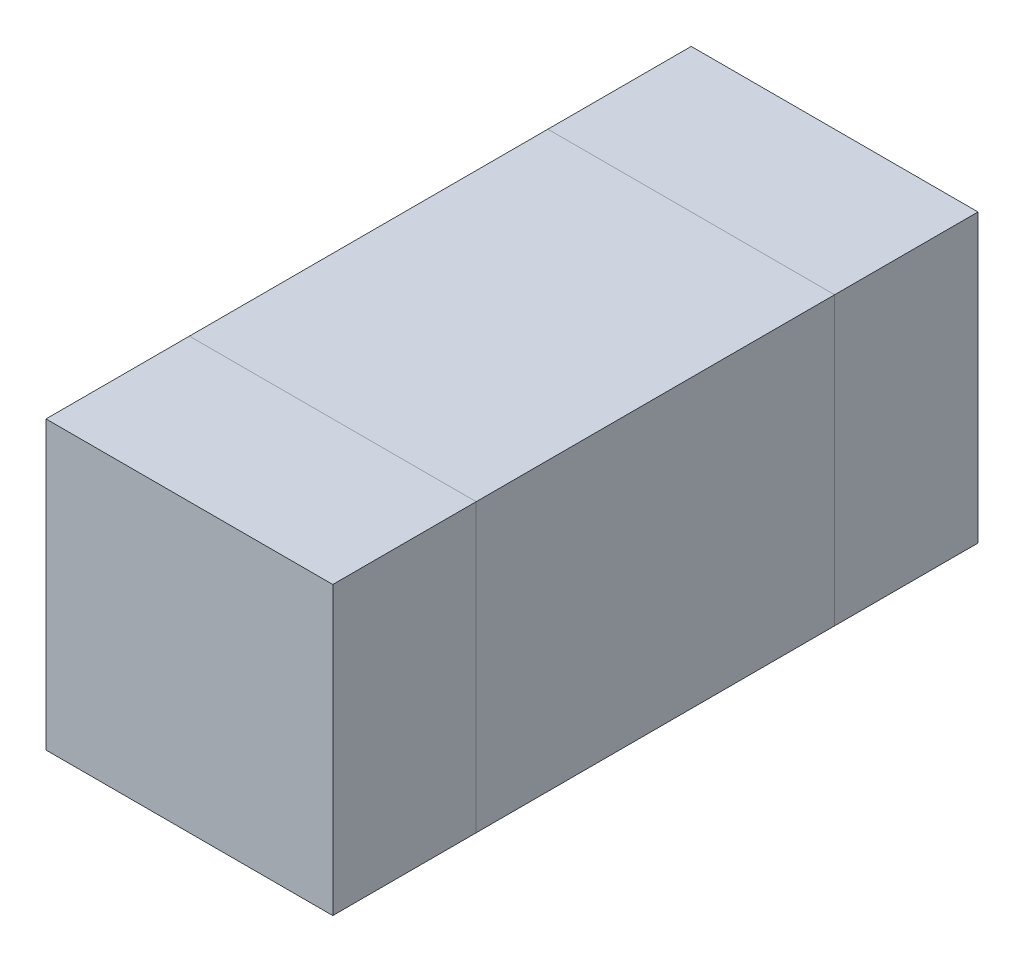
ISO-10303-21;
HEADER;
FILE_DESCRIPTION(('STEP AP214'),'2;1');
FILE_NAME('part.step','',(''),(''),'','','');
FILE_SCHEMA(('AUTOMOTIVE_DESIGN { 1 0 10303 214 1 1 1 1 }'));
ENDSEC;
DATA;
#1=APPLICATION_CONTEXT('core data for automotive mechanical design processes');
#2=APPLICATION_PROTOCOL_DEFINITION('international standard','automotive_design',2000,#1);
#3=PRODUCT_CONTEXT('',#1,'mechanical');
#4=PRODUCT('Part','Part','',(#3));
#5=PRODUCT_RELATED_PRODUCT_CATEGORY('part','',(#4));
#6=PRODUCT_DEFINITION_FORMATION('','',#4);
#7=PRODUCT_DEFINITION_CONTEXT('part definition',#1,'design');
#8=PRODUCT_DEFINITION('design','',#6,#7);
#9=PRODUCT_DEFINITION_SHAPE('','',#8);
#10=(LENGTH_UNIT() NAMED_UNIT(*) SI_UNIT(.MILLI.,.METRE.));
#11=(NAMED_UNIT(*) PLANE_ANGLE_UNIT() SI_UNIT($,.RADIAN.));
#12=(NAMED_UNIT(*) SI_UNIT($,.STERADIAN.) SOLID_ANGLE_UNIT());
#13=UNCERTAINTY_MEASURE_WITH_UNIT(LENGTH_MEASURE(1.E-05),#10,'distance_accuracy_value','');
#14=(GEOMETRIC_REPRESENTATION_CONTEXT(3) GLOBAL_UNCERTAINTY_ASSIGNED_CONTEXT((#13)) GLOBAL_UNIT_ASSIGNED_CONTEXT((#10,
#11,#12)) REPRESENTATION_CONTEXT('',''));
#15=CARTESIAN_POINT('',(0.,0.,0.));
#16=DIRECTION('',(0.,0.,1.));
#17=DIRECTION('',(1.,0.,0.));
#18=AXIS2_PLACEMENT_3D('',#15,#16,#17);
#19=CARTESIAN_POINT('',(0.,0.8,0.));
#20=DIRECTION('',(0.,1.,0.));
#21=DIRECTION('',(0.,0.,1.));
#22=AXIS2_PLACEMENT_3D('',#19,#20,#21);
#23=PLANE('',#22);
#24=DIRECTION('',(0.,0.,-1.));
#25=VECTOR('',#24,1.);
#26=CARTESIAN_POINT('',(-0.4,0.8,-0.5));
#27=LINE('',#26,#25);
#28=CARTESIAN_POINT('',(-0.4,0.8,-0.5));
#29=VERTEX_POINT('',#28);
#30=CARTESIAN_POINT('',(-0.4,0.8,-0.9));
#31=VERTEX_POINT('',#30);
#32=EDGE_CURVE('E51',#29,#31,#27,.T.);
#33=ORIENTED_EDGE('',*,*,#32,.F.);
#34=DIRECTION('',(-1.,0.,0.));
#35=VECTOR('',#34,1.);
#36=CARTESIAN_POINT('',(-0.4,0.8,-0.5));
#37=LINE('',#36,#35);
#38=CARTESIAN_POINT('',(0.4,0.8,-0.5));
#39=VERTEX_POINT('',#38);
#40=EDGE_CURVE('E74',#39,#29,#37,.T.);
#41=ORIENTED_EDGE('',*,*,#40,.F.);
#42=DIRECTION('',(0.,0.,1.));
#43=VECTOR('',#42,1.);
#44=CARTESIAN_POINT('',(0.4,0.8,-0.5));
#45=LINE('',#44,#43);
#46=CARTESIAN_POINT('',(0.4,0.8,-0.9));
#47=VERTEX_POINT('',#46);
#48=EDGE_CURVE('E79',#47,#39,#45,.T.);
#49=ORIENTED_EDGE('',*,*,#48,.F.);
#50=DIRECTION('',(1.,0.,0.));
#51=VECTOR('',#50,1.);
#52=CARTESIAN_POINT('',(-0.4,0.8,-0.9));
#53=LINE('',#52,#51);
#54=EDGE_CURVE('E94',#31,#47,#53,.T.);
#55=ORIENTED_EDGE('',*,*,#54,.F.);
#56=EDGE_LOOP('',(#33,#41,#49,#55));
#57=FACE_BOUND('',#56,.T.);
#58=ADVANCED_FACE('F43',(#57),#23,.T.);
#59=CARTESIAN_POINT('',(0.,0.,0.));
#60=DIRECTION('',(0.,-1.,0.));
#61=DIRECTION('',(0.,0.,-1.));
#62=AXIS2_PLACEMENT_3D('',#59,#60,#61);
#63=PLANE('',#62);
#64=DIRECTION('',(0.,0.,-1.));
#65=VECTOR('',#64,1.);
#66=CARTESIAN_POINT('',(-0.4,0.,-0.5));
#67=LINE('',#66,#65);
#68=CARTESIAN_POINT('',(-0.4,0.,-0.5));
#69=VERTEX_POINT('',#68);
#70=CARTESIAN_POINT('',(-0.4,0.,-0.9));
#71=VERTEX_POINT('',#70);
#72=EDGE_CURVE('E103',#69,#71,#67,.T.);
#73=ORIENTED_EDGE('',*,*,#72,.T.);
#74=DIRECTION('',(1.,0.,0.));
#75=VECTOR('',#74,1.);
#76=CARTESIAN_POINT('',(-0.4,0.,-0.9));
#77=LINE('',#76,#75);
#78=CARTESIAN_POINT('',(0.4,0.,-0.9));
#79=VERTEX_POINT('',#78);
#80=EDGE_CURVE('E92',#71,#79,#77,.T.);
#81=ORIENTED_EDGE('',*,*,#80,.T.);
#82=DIRECTION('',(0.,0.,1.));
#83=VECTOR('',#82,1.);
#84=CARTESIAN_POINT('',(0.4,0.,-0.5));
#85=LINE('',#84,#83);
#86=CARTESIAN_POINT('',(0.4,0.,-0.5));
#87=VERTEX_POINT('',#86);
#88=EDGE_CURVE('E95',#79,#87,#85,.T.);
#89=ORIENTED_EDGE('',*,*,#88,.T.);
#90=DIRECTION('',(-1.,0.,0.));
#91=VECTOR('',#90,1.);
#92=CARTESIAN_POINT('',(-0.4,0.,-0.5));
#93=LINE('',#92,#91);
#94=EDGE_CURVE('E100',#87,#69,#93,.T.);
#95=ORIENTED_EDGE('',*,*,#94,.T.);
#96=EDGE_LOOP('',(#73,#81,#89,#95));
#97=FACE_BOUND('',#96,.T.);
#98=ADVANCED_FACE('F102',(#97),#63,.T.);
#99=CARTESIAN_POINT('',(-0.4,1.69442719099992,-0.9));
#100=DIRECTION('',(0.,0.,-1.));
#101=DIRECTION('',(-1.,0.,0.));
#102=AXIS2_PLACEMENT_3D('',#99,#100,#101);
#103=PLANE('',#102);
#104=DIRECTION('',(0.,-1.,0.));
#105=VECTOR('',#104,1.);
#106=CARTESIAN_POINT('',(-0.4,1.69442719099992,-0.9));
#107=LINE('',#106,#105);
#108=EDGE_CURVE('E12',#31,#71,#107,.T.);
#109=ORIENTED_EDGE('',*,*,#108,.F.);
#110=ORIENTED_EDGE('',*,*,#54,.T.);
#111=DIRECTION('',(0.,-1.,0.));
#112=VECTOR('',#111,1.);
#113=CARTESIAN_POINT('',(0.4,1.69442719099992,-0.9));
#114=LINE('',#113,#112);
#115=EDGE_CURVE('E89',#47,#79,#114,.T.);
#116=ORIENTED_EDGE('',*,*,#115,.T.);
#117=ORIENTED_EDGE('',*,*,#80,.F.);
#118=EDGE_LOOP('',(#109,#110,#116,#117));
#119=FACE_BOUND('',#118,.T.);
#120=ADVANCED_FACE('F90',(#119),#103,.T.);
#121=CARTESIAN_POINT('',(0.4,1.69442719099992,-0.5));
#122=DIRECTION('',(1.,0.,0.));
#123=DIRECTION('',(0.,0.,-1.));
#124=AXIS2_PLACEMENT_3D('',#121,#122,#123);
#125=PLANE('',#124);
#126=ORIENTED_EDGE('',*,*,#115,.F.);
#127=ORIENTED_EDGE('',*,*,#48,.T.);
#128=DIRECTION('',(0.,-1.,0.));
#129=VECTOR('',#128,1.);
#130=CARTESIAN_POINT('',(0.4,1.69442719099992,-0.5));
#131=LINE('',#130,#129);
#132=EDGE_CURVE('E84',#39,#87,#131,.T.);
#133=ORIENTED_EDGE('',*,*,#132,.T.);
#134=ORIENTED_EDGE('',*,*,#88,.F.);
#135=EDGE_LOOP('',(#126,#127,#133,#134));
#136=FACE_BOUND('',#135,.T.);
#137=ADVANCED_FACE('F96',(#136),#125,.T.);
#138=CARTESIAN_POINT('',(-0.4,1.69442719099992,-0.5));
#139=DIRECTION('',(0.,0.,1.));
#140=DIRECTION('',(1.,0.,0.));
#141=AXIS2_PLACEMENT_3D('',#138,#139,#140);
#142=PLANE('',#141);
#143=ORIENTED_EDGE('',*,*,#132,.F.);
#144=ORIENTED_EDGE('',*,*,#40,.T.);
#145=DIRECTION('',(0.,-1.,0.));
#146=VECTOR('',#145,1.);
#147=CARTESIAN_POINT('',(-0.4,1.69442719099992,-0.5));
#148=LINE('',#147,#146);
#149=EDGE_CURVE('E110',#29,#69,#148,.T.);
#150=ORIENTED_EDGE('',*,*,#149,.T.);
#151=ORIENTED_EDGE('',*,*,#94,.F.);
#152=EDGE_LOOP('',(#143,#144,#150,#151));
#153=FACE_BOUND('',#152,.T.);
#154=ADVANCED_FACE('F116',(#153),#142,.T.);
#155=CARTESIAN_POINT('',(-0.4,1.69442719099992,-0.5));
#156=DIRECTION('',(-1.,0.,0.));
#157=DIRECTION('',(0.,0.,1.));
#158=AXIS2_PLACEMENT_3D('',#155,#156,#157);
#159=PLANE('',#158);
#160=ORIENTED_EDGE('',*,*,#149,.F.);
#161=ORIENTED_EDGE('',*,*,#32,.T.);
#162=ORIENTED_EDGE('',*,*,#108,.T.);
#163=ORIENTED_EDGE('',*,*,#72,.F.);
#164=EDGE_LOOP('',(#160,#161,#162,#163));
#165=FACE_BOUND('',#164,.T.);
#166=ADVANCED_FACE('F117',(#165),#159,.T.);
#167=CLOSED_SHELL('',(#58,#98,#120,#137,#154,#166));
#168=MANIFOLD_SOLID_BREP('B2',#167);
#169=CARTESIAN_POINT('',(0.,0.8,0.));
#170=DIRECTION('',(0.,1.,0.));
#171=DIRECTION('',(0.,0.,1.));
#172=AXIS2_PLACEMENT_3D('',#169,#170,#171);
#173=PLANE('',#172);
#174=DIRECTION('',(0.,0.,-1.));
#175=VECTOR('',#174,1.);
#176=CARTESIAN_POINT('',(-0.4,0.8,0.5));
#177=LINE('',#176,#175);
#178=CARTESIAN_POINT('',(-0.4,0.8,0.9));
#179=VERTEX_POINT('',#178);
#180=CARTESIAN_POINT('',(-0.4,0.8,0.5));
#181=VERTEX_POINT('',#180);
#182=EDGE_CURVE('E183',#179,#181,#177,.T.);
#183=ORIENTED_EDGE('',*,*,#182,.F.);
#184=DIRECTION('',(-1.,0.,0.));
#185=VECTOR('',#184,1.);
#186=CARTESIAN_POINT('',(-0.4,0.8,0.9));
#187=LINE('',#186,#185);
#188=CARTESIAN_POINT('',(0.4,0.8,0.9));
#189=VERTEX_POINT('',#188);
#190=EDGE_CURVE('E206',#189,#179,#187,.T.);
#191=ORIENTED_EDGE('',*,*,#190,.F.);
#192=DIRECTION('',(0.,0.,1.));
#193=VECTOR('',#192,1.);
#194=CARTESIAN_POINT('',(0.4,0.8,0.5));
#195=LINE('',#194,#193);
#196=CARTESIAN_POINT('',(0.4,0.8,0.5));
#197=VERTEX_POINT('',#196);
#198=EDGE_CURVE('E211',#197,#189,#195,.T.);
#199=ORIENTED_EDGE('',*,*,#198,.F.);
#200=DIRECTION('',(1.,0.,0.));
#201=VECTOR('',#200,1.);
#202=CARTESIAN_POINT('',(-0.4,0.8,0.5));
#203=LINE('',#202,#201);
#204=EDGE_CURVE('E226',#181,#197,#203,.T.);
#205=ORIENTED_EDGE('',*,*,#204,.F.);
#206=EDGE_LOOP('',(#183,#191,#199,#205));
#207=FACE_BOUND('',#206,.T.);
#208=ADVANCED_FACE('F175',(#207),#173,.T.);
#209=CARTESIAN_POINT('',(0.,0.,0.));
#210=DIRECTION('',(0.,1.,0.));
#211=DIRECTION('',(0.,0.,1.));
#212=AXIS2_PLACEMENT_3D('',#209,#210,#211);
#213=PLANE('',#212);
#214=DIRECTION('',(0.,0.,-1.));
#215=VECTOR('',#214,1.);
#216=CARTESIAN_POINT('',(-0.4,0.,0.5));
#217=LINE('',#216,#215);
#218=CARTESIAN_POINT('',(-0.4,0.,0.9));
#219=VERTEX_POINT('',#218);
#220=CARTESIAN_POINT('',(-0.4,0.,0.5));
#221=VERTEX_POINT('',#220);
#222=EDGE_CURVE('E235',#219,#221,#217,.T.);
#223=ORIENTED_EDGE('',*,*,#222,.T.);
#224=DIRECTION('',(1.,0.,0.));
#225=VECTOR('',#224,1.);
#226=CARTESIAN_POINT('',(-0.4,0.,0.5));
#227=LINE('',#226,#225);
#228=CARTESIAN_POINT('',(0.4,0.,0.5));
#229=VERTEX_POINT('',#228);
#230=EDGE_CURVE('E224',#221,#229,#227,.T.);
#231=ORIENTED_EDGE('',*,*,#230,.T.);
#232=DIRECTION('',(0.,0.,1.));
#233=VECTOR('',#232,1.);
#234=CARTESIAN_POINT('',(0.4,0.,0.5));
#235=LINE('',#234,#233);
#236=CARTESIAN_POINT('',(0.4,0.,0.9));
#237=VERTEX_POINT('',#236);
#238=EDGE_CURVE('E227',#229,#237,#235,.T.);
#239=ORIENTED_EDGE('',*,*,#238,.T.);
#240=DIRECTION('',(-1.,0.,0.));
#241=VECTOR('',#240,1.);
#242=CARTESIAN_POINT('',(-0.4,0.,0.9));
#243=LINE('',#242,#241);
#244=EDGE_CURVE('E232',#237,#219,#243,.T.);
#245=ORIENTED_EDGE('',*,*,#244,.T.);
#246=EDGE_LOOP('',(#223,#231,#239,#245));
#247=FACE_BOUND('',#246,.T.);
#248=ADVANCED_FACE('F234',(#247),#213,.F.);
#249=CARTESIAN_POINT('',(-0.4,1.69442719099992,0.5));
#250=DIRECTION('',(0.,0.,-1.));
#251=DIRECTION('',(-1.,0.,0.));
#252=AXIS2_PLACEMENT_3D('',#249,#250,#251);
#253=PLANE('',#252);
#254=DIRECTION('',(0.,-1.,0.));
#255=VECTOR('',#254,1.);
#256=CARTESIAN_POINT('',(-0.4,1.69442719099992,0.5));
#257=LINE('',#256,#255);
#258=EDGE_CURVE('E41',#181,#221,#257,.T.);
#259=ORIENTED_EDGE('',*,*,#258,.F.);
#260=ORIENTED_EDGE('',*,*,#204,.T.);
#261=DIRECTION('',(0.,-1.,0.));
#262=VECTOR('',#261,1.);
#263=CARTESIAN_POINT('',(0.4,1.69442719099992,0.5));
#264=LINE('',#263,#262);
#265=EDGE_CURVE('E221',#197,#229,#264,.T.);
#266=ORIENTED_EDGE('',*,*,#265,.T.);
#267=ORIENTED_EDGE('',*,*,#230,.F.);
#268=EDGE_LOOP('',(#259,#260,#266,#267));
#269=FACE_BOUND('',#268,.T.);
#270=ADVANCED_FACE('F222',(#269),#253,.T.);
#271=CARTESIAN_POINT('',(0.4,1.69442719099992,0.5));
#272=DIRECTION('',(1.,0.,0.));
#273=DIRECTION('',(0.,0.,-1.));
#274=AXIS2_PLACEMENT_3D('',#271,#272,#273);
#275=PLANE('',#274);
#276=ORIENTED_EDGE('',*,*,#265,.F.);
#277=ORIENTED_EDGE('',*,*,#198,.T.);
#278=DIRECTION('',(0.,-1.,0.));
#279=VECTOR('',#278,1.);
#280=CARTESIAN_POINT('',(0.4,1.69442719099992,0.9));
#281=LINE('',#280,#279);
#282=EDGE_CURVE('E216',#189,#237,#281,.T.);
#283=ORIENTED_EDGE('',*,*,#282,.T.);
#284=ORIENTED_EDGE('',*,*,#238,.F.);
#285=EDGE_LOOP('',(#276,#277,#283,#284));
#286=FACE_BOUND('',#285,.T.);
#287=ADVANCED_FACE('F228',(#286),#275,.T.);
#288=CARTESIAN_POINT('',(-0.4,1.69442719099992,0.9));
#289=DIRECTION('',(0.,0.,1.));
#290=DIRECTION('',(1.,0.,0.));
#291=AXIS2_PLACEMENT_3D('',#288,#289,#290);
#292=PLANE('',#291);
#293=ORIENTED_EDGE('',*,*,#282,.F.);
#294=ORIENTED_EDGE('',*,*,#190,.T.);
#295=DIRECTION('',(0.,-1.,0.));
#296=VECTOR('',#295,1.);
#297=CARTESIAN_POINT('',(-0.4,1.69442719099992,0.9));
#298=LINE('',#297,#296);
#299=EDGE_CURVE('E242',#179,#219,#298,.T.);
#300=ORIENTED_EDGE('',*,*,#299,.T.);
#301=ORIENTED_EDGE('',*,*,#244,.F.);
#302=EDGE_LOOP('',(#293,#294,#300,#301));
#303=FACE_BOUND('',#302,.T.);
#304=ADVANCED_FACE('F248',(#303),#292,.T.);
#305=CARTESIAN_POINT('',(-0.4,1.69442719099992,0.5));
#306=DIRECTION('',(-1.,0.,0.));
#307=DIRECTION('',(0.,0.,1.));
#308=AXIS2_PLACEMENT_3D('',#305,#306,#307);
#309=PLANE('',#308);
#310=ORIENTED_EDGE('',*,*,#299,.F.);
#311=ORIENTED_EDGE('',*,*,#182,.T.);
#312=ORIENTED_EDGE('',*,*,#258,.T.);
#313=ORIENTED_EDGE('',*,*,#222,.F.);
#314=EDGE_LOOP('',(#310,#311,#312,#313));
#315=FACE_BOUND('',#314,.T.);
#316=ADVANCED_FACE('F249',(#315),#309,.T.);
#317=CLOSED_SHELL('',(#208,#248,#270,#287,#304,#316));
#318=MANIFOLD_SOLID_BREP('B6',#317);
#319=CARTESIAN_POINT('',(0.4,0.8,-0.5));
#320=DIRECTION('',(-1.,0.,0.));
#321=DIRECTION('',(0.,0.,1.));
#322=AXIS2_PLACEMENT_3D('',#319,#320,#321);
#323=PLANE('',#322);
#324=DIRECTION('',(0.,0.,-1.));
#325=VECTOR('',#324,1.);
#326=CARTESIAN_POINT('',(0.4,0.,-0.5));
#327=LINE('',#326,#325);
#328=CARTESIAN_POINT('',(0.4,0.,0.5));
#329=VERTEX_POINT('',#328);
#330=CARTESIAN_POINT('',(0.4,0.,-0.5));
#331=VERTEX_POINT('',#330);
#332=EDGE_CURVE('E361',#329,#331,#327,.T.);
#333=ORIENTED_EDGE('',*,*,#332,.T.);
#334=DIRECTION('',(0.,-1.,0.));
#335=VECTOR('',#334,1.);
#336=CARTESIAN_POINT('',(0.4,0.8,-0.5));
#337=LINE('',#336,#335);
#338=CARTESIAN_POINT('',(0.4,0.8,-0.5));
#339=VERTEX_POINT('',#338);
#340=EDGE_CURVE('E173',#339,#331,#337,.T.);
#341=ORIENTED_EDGE('',*,*,#340,.F.);
#342=DIRECTION('',(0.,0.,-1.));
#343=VECTOR('',#342,1.);
#344=CARTESIAN_POINT('',(0.4,0.8,-0.5));
#345=LINE('',#344,#343);
#346=CARTESIAN_POINT('',(0.4,0.8,0.5));
#347=VERTEX_POINT('',#346);
#348=EDGE_CURVE('E349',#347,#339,#345,.T.);
#349=ORIENTED_EDGE('',*,*,#348,.F.);
#350=DIRECTION('',(0.,-1.,0.));
#351=VECTOR('',#350,1.);
#352=CARTESIAN_POINT('',(0.4,0.8,0.5));
#353=LINE('',#352,#351);
#354=EDGE_CURVE('E357',#347,#329,#353,.T.);
#355=ORIENTED_EDGE('',*,*,#354,.T.);
#356=EDGE_LOOP('',(#333,#341,#349,#355));
#357=FACE_BOUND('',#356,.T.);
#358=ADVANCED_FACE('F298',(#357),#323,.F.);
#359=CARTESIAN_POINT('',(-0.4,0.8,-0.5));
#360=DIRECTION('',(0.,0.,1.));
#361=DIRECTION('',(1.,0.,0.));
#362=AXIS2_PLACEMENT_3D('',#359,#360,#361);
#363=PLANE('',#362);
#364=DIRECTION('',(-1.,0.,0.));
#365=VECTOR('',#364,1.);
#366=CARTESIAN_POINT('',(-0.4,0.,-0.5));
#367=LINE('',#366,#365);
#368=CARTESIAN_POINT('',(-0.4,0.,-0.5));
#369=VERTEX_POINT('',#368);
#370=EDGE_CURVE('E353',#331,#369,#367,.T.);
#371=ORIENTED_EDGE('',*,*,#370,.T.);
#372=DIRECTION('',(0.,-1.,0.));
#373=VECTOR('',#372,1.);
#374=CARTESIAN_POINT('',(-0.4,0.8,-0.5));
#375=LINE('',#374,#373);
#376=CARTESIAN_POINT('',(-0.4,0.8,-0.5));
#377=VERTEX_POINT('',#376);
#378=EDGE_CURVE('E306',#377,#369,#375,.T.);
#379=ORIENTED_EDGE('',*,*,#378,.F.);
#380=DIRECTION('',(-1.,0.,0.));
#381=VECTOR('',#380,1.);
#382=CARTESIAN_POINT('',(-0.4,0.8,-0.5));
#383=LINE('',#382,#381);
#384=EDGE_CURVE('E344',#339,#377,#383,.T.);
#385=ORIENTED_EDGE('',*,*,#384,.F.);
#386=ORIENTED_EDGE('',*,*,#340,.T.);
#387=EDGE_LOOP('',(#371,#379,#385,#386));
#388=FACE_BOUND('',#387,.T.);
#389=ADVANCED_FACE('F352',(#388),#363,.F.);
#390=CARTESIAN_POINT('',(-0.4,0.8,-0.5));
#391=DIRECTION('',(1.,0.,0.));
#392=DIRECTION('',(0.,0.,-1.));
#393=AXIS2_PLACEMENT_3D('',#390,#391,#392);
#394=PLANE('',#393);
#395=DIRECTION('',(0.,0.,1.));
#396=VECTOR('',#395,1.);
#397=CARTESIAN_POINT('',(-0.4,0.,-0.5));
#398=LINE('',#397,#396);
#399=CARTESIAN_POINT('',(-0.4,0.,0.5));
#400=VERTEX_POINT('',#399);
#401=EDGE_CURVE('E331',#369,#400,#398,.T.);
#402=ORIENTED_EDGE('',*,*,#401,.T.);
#403=DIRECTION('',(0.,-1.,0.));
#404=VECTOR('',#403,1.);
#405=CARTESIAN_POINT('',(-0.4,0.8,0.5));
#406=LINE('',#405,#404);
#407=CARTESIAN_POINT('',(-0.4,0.8,0.5));
#408=VERTEX_POINT('',#407);
#409=EDGE_CURVE('E354',#408,#400,#406,.T.);
#410=ORIENTED_EDGE('',*,*,#409,.F.);
#411=DIRECTION('',(0.,0.,1.));
#412=VECTOR('',#411,1.);
#413=CARTESIAN_POINT('',(-0.4,0.8,-0.5));
#414=LINE('',#413,#412);
#415=EDGE_CURVE('E347',#377,#408,#414,.T.);
#416=ORIENTED_EDGE('',*,*,#415,.F.);
#417=ORIENTED_EDGE('',*,*,#378,.T.);
#418=EDGE_LOOP('',(#402,#410,#416,#417));
#419=FACE_BOUND('',#418,.T.);
#420=ADVANCED_FACE('F355',(#419),#394,.F.);
#421=CARTESIAN_POINT('',(-0.4,0.8,0.5));
#422=DIRECTION('',(0.,0.,-1.));
#423=DIRECTION('',(-1.,0.,0.));
#424=AXIS2_PLACEMENT_3D('',#421,#422,#423);
#425=PLANE('',#424);
#426=DIRECTION('',(1.,0.,0.));
#427=VECTOR('',#426,1.);
#428=CARTESIAN_POINT('',(-0.4,0.,0.5));
#429=LINE('',#428,#427);
#430=EDGE_CURVE('E337',#400,#329,#429,.T.);
#431=ORIENTED_EDGE('',*,*,#430,.T.);
#432=ORIENTED_EDGE('',*,*,#354,.F.);
#433=DIRECTION('',(1.,0.,0.));
#434=VECTOR('',#433,1.);
#435=CARTESIAN_POINT('',(-0.4,0.8,0.5));
#436=LINE('',#435,#434);
#437=EDGE_CURVE('E314',#408,#347,#436,.T.);
#438=ORIENTED_EDGE('',*,*,#437,.F.);
#439=ORIENTED_EDGE('',*,*,#409,.T.);
#440=EDGE_LOOP('',(#431,#432,#438,#439));
#441=FACE_BOUND('',#440,.T.);
#442=ADVANCED_FACE('F368',(#441),#425,.F.);
#443=CARTESIAN_POINT('',(0.,0.8,0.));
#444=DIRECTION('',(0.,1.,0.));
#445=DIRECTION('',(0.,0.,1.));
#446=AXIS2_PLACEMENT_3D('',#443,#444,#445);
#447=PLANE('',#446);
#448=ORIENTED_EDGE('',*,*,#348,.T.);
#449=ORIENTED_EDGE('',*,*,#384,.T.);
#450=ORIENTED_EDGE('',*,*,#415,.T.);
#451=ORIENTED_EDGE('',*,*,#437,.T.);
#452=EDGE_LOOP('',(#448,#449,#450,#451));
#453=FACE_BOUND('',#452,.T.);
#454=ADVANCED_FACE('F345',(#453),#447,.T.);
#455=CARTESIAN_POINT('',(0.,0.,0.));
#456=DIRECTION('',(0.,1.,0.));
#457=DIRECTION('',(0.,0.,1.));
#458=AXIS2_PLACEMENT_3D('',#455,#456,#457);
#459=PLANE('',#458);
#460=ORIENTED_EDGE('',*,*,#332,.F.);
#461=ORIENTED_EDGE('',*,*,#430,.F.);
#462=ORIENTED_EDGE('',*,*,#401,.F.);
#463=ORIENTED_EDGE('',*,*,#370,.F.);
#464=EDGE_LOOP('',(#460,#461,#462,#463));
#465=FACE_BOUND('',#464,.T.);
#466=ADVANCED_FACE('F371',(#465),#459,.F.);
#467=CLOSED_SHELL('',(#358,#389,#420,#442,#454,#466));
#468=MANIFOLD_SOLID_BREP('B35',#467);
#469=ADVANCED_BREP_SHAPE_REPRESENTATION('',(#18,#168,#318,#468),#14);
#470=SHAPE_DEFINITION_REPRESENTATION(#9,#469);
ENDSEC;
END-ISO-10303-21;
